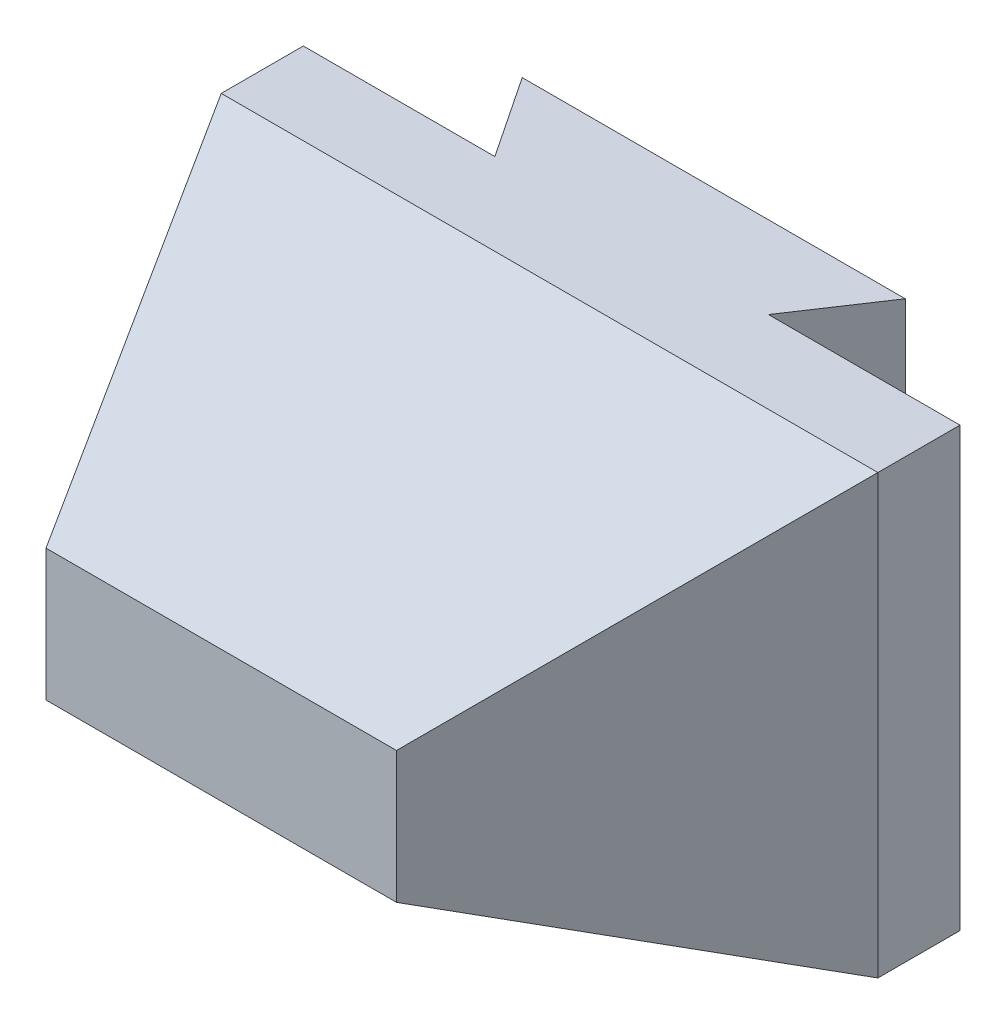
from build123d import *

# Parameters (mm, degrees)
SKETCH_1_W          = 120
SKETCH_1_H          = 80
EXTRUDE_1_DEPTH     = 60
EXTRUDE_1_TAPER     = 25
SKETCH_2_W          = 120
SKETCH_2_H          = 80
EXTRUDE_2_DEPTH     = 30
CUT_EXTRUDE_1_DEPTH = 117.619037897


with BuildPart() as part:
    # Sketch 1 → Extrude 1 (new body)
    with BuildSketch(Plane.XY):
        Rectangle(SKETCH_1_W, SKETCH_1_H)
    extrude(amount=EXTRUDE_1_DEPTH, taper=EXTRUDE_1_TAPER)

    # Sketch 2 → Extrude 2 (add)
    with BuildSketch(Plane(origin=(0, 0, 0), x_dir=(-1, 0, 0), z_dir=(0, 0, -1))):
        Rectangle(SKETCH_2_W, SKETCH_2_H)
    extrude(amount=EXTRUDE_2_DEPTH)

    # Sketch 3 → Cut-Extrude 1 (cut, through all)
    with BuildSketch(Plane(origin=(0, 40, 0), x_dir=(1, 0, 0), z_dir=(0, 1, 0))):
        Polygon((-60, 15), (-25, 15), (-35, 30), (-60, 30), align=None)
    cut_extrude_1 = extrude(amount=-CUT_EXTRUDE_1_DEPTH, mode=Mode.SUBTRACT)

    # Mirror 1: Cut-Extrude 1 across plane
    add(cut_extrude_1.mirror(Plane(origin=(0, 0, 0), x_dir=(0, 0, 1), z_dir=(1, 0, 0))), mode=Mode.SUBTRACT)


solid = part.part
